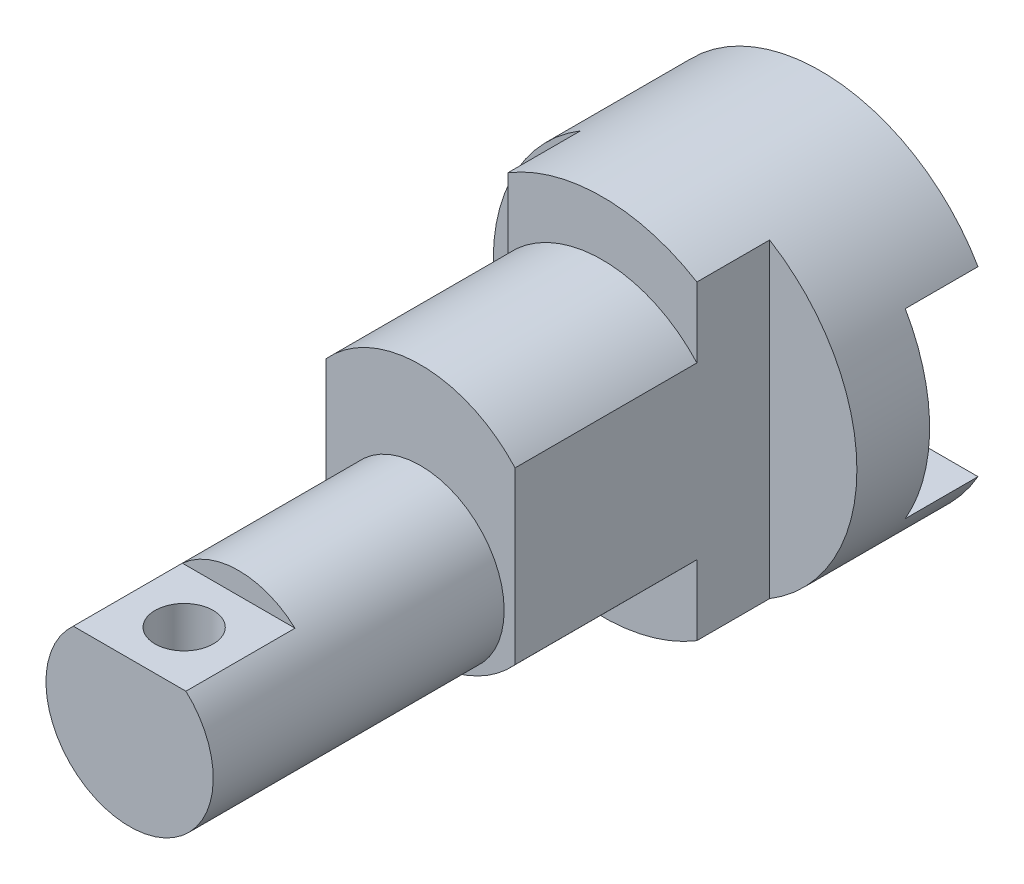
from build123d import *

# Parameters (mm, degrees)
SKETCH_1_R          = 50
EXTRUDE_1_DEPTH     = 60
SKETCH_2_R          = 35
EXTRUDE_2_DEPTH     = 50
SKETCH_3_R          = 23
EXTRUDE_3_DEPTH     = 80
SKETCH_4_W          = 40
SKETCH_4_H          = 30
CUT_EXTRUDE_1_DEPTH = 15
SKETCH_5_R          = 8
CUT_EXTRUDE_2_DEPTH = 205.022057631
CUT_EXTRUDE_3_DEPTH = 166.831239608
SKETCH_7_W          = 20
SKETCH_7_H          = 50
CUT_EXTRUDE_4_DEPTH = 60


with BuildPart() as part:
    # Sketch 1 → Extrude 1 (new body)
    with BuildSketch(Plane.XY):
        Circle(SKETCH_1_R)
    extrude(amount=EXTRUDE_1_DEPTH)

    # Sketch 2 → Extrude 2 (add)
    with BuildSketch(Plane.XY.offset(60)):
        Circle(SKETCH_2_R)
    extrude(amount=EXTRUDE_2_DEPTH)

    # Sketch 3 → Extrude 3 (add)
    with BuildSketch(Plane.XY.offset(110)):
        with Locations(Location((0, -12, 0), (0, 0, 270))):
            Circle(SKETCH_3_R)
    extrude(amount=EXTRUDE_3_DEPTH)

    # Sketch 4 → Cut-Extrude 1 (cut)
    with BuildSketch(Plane(origin=(0, 20, 0), x_dir=(1, 0, 0), z_dir=(0, 1, 0))):
        with Locations((0, -175)):
            Rectangle(SKETCH_4_W, SKETCH_4_H)
    extrude(amount=-CUT_EXTRUDE_1_DEPTH, mode=Mode.SUBTRACT)

    # Sketch 5 → Cut-Extrude 2 (cut, through all)
    with BuildSketch(Plane(origin=(0, 5, 0), x_dir=(1, 0, 0), z_dir=(0, 1, 0))):
        with Locations(Location((0, -175, 0), (0, 0, 270))):
            Circle(SKETCH_5_R)
    extrude(amount=-CUT_EXTRUDE_2_DEPTH, mode=Mode.SUBTRACT)

    # Sketch 6 → Cut-Extrude 3 (cut, through all)
    with BuildSketch(Plane.XY.offset(40)):
        with BuildLine():
            Line((26, -42.708313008), (26, 42.708313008))
            ThreePointArc((26, 42.708313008), (50, 0), (26, -42.708313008))
        make_face()
        with BuildLine():
            Line((-26, 42.708313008), (-26, -42.708313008))
            ThreePointArc((-26, -42.708313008), (-50, 0), (-26, 42.708313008))
        make_face()
    extrude(amount=CUT_EXTRUDE_3_DEPTH, mode=Mode.SUBTRACT)

    # Sketch 7 → Cut-Extrude 4 (cut, symmetric)
    with BuildSketch(Plane(origin=(0, 0, 0), x_dir=(0, 0, -1), z_dir=(1, 0, 0))):
        with Locations((-10, 0)):
            Rectangle(SKETCH_7_W, SKETCH_7_H)
    extrude(amount=CUT_EXTRUDE_4_DEPTH, both=True, mode=Mode.SUBTRACT)


solid = part.part
